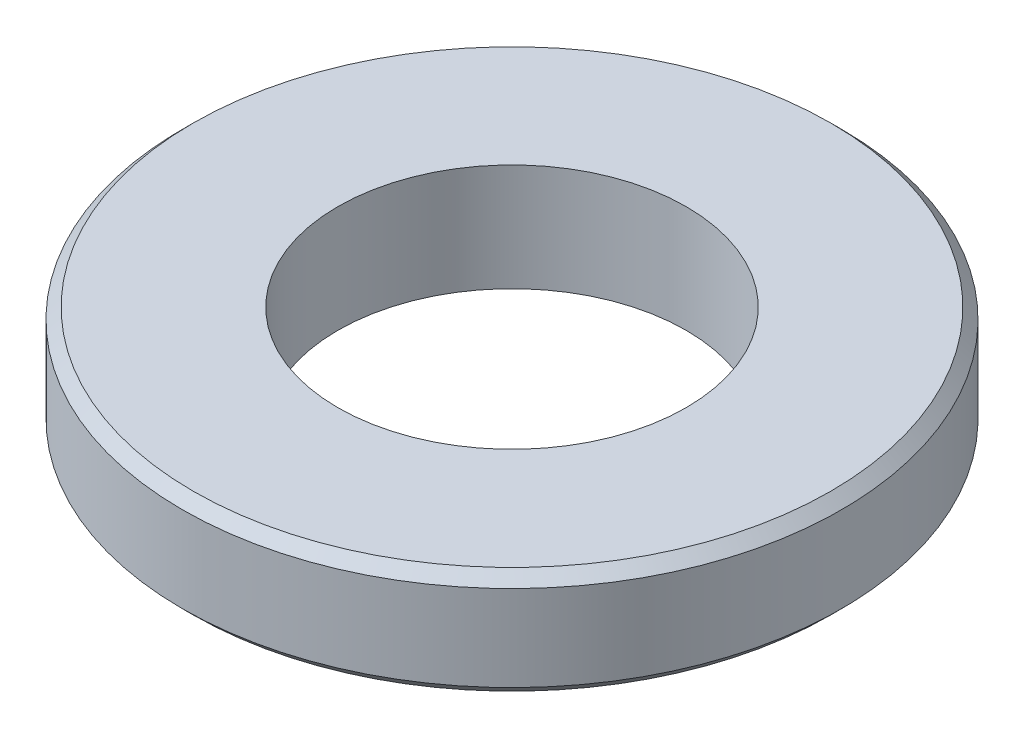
ISO-10303-21;
HEADER;
FILE_DESCRIPTION(('STEP AP214'),'2;1');
FILE_NAME('part.step','',(''),(''),'','','');
FILE_SCHEMA(('AUTOMOTIVE_DESIGN { 1 0 10303 214 1 1 1 1 }'));
ENDSEC;
DATA;
#1=APPLICATION_CONTEXT('core data for automotive mechanical design processes');
#2=APPLICATION_PROTOCOL_DEFINITION('international standard','automotive_design',2000,#1);
#3=PRODUCT_CONTEXT('',#1,'mechanical');
#4=PRODUCT('Part','Part','',(#3));
#5=PRODUCT_RELATED_PRODUCT_CATEGORY('part','',(#4));
#6=PRODUCT_DEFINITION_FORMATION('','',#4);
#7=PRODUCT_DEFINITION_CONTEXT('part definition',#1,'design');
#8=PRODUCT_DEFINITION('design','',#6,#7);
#9=PRODUCT_DEFINITION_SHAPE('','',#8);
#10=(LENGTH_UNIT() NAMED_UNIT(*) SI_UNIT(.MILLI.,.METRE.));
#11=(NAMED_UNIT(*) PLANE_ANGLE_UNIT() SI_UNIT($,.RADIAN.));
#12=(NAMED_UNIT(*) SI_UNIT($,.STERADIAN.) SOLID_ANGLE_UNIT());
#13=UNCERTAINTY_MEASURE_WITH_UNIT(LENGTH_MEASURE(1.E-05),#10,'distance_accuracy_value','');
#14=(GEOMETRIC_REPRESENTATION_CONTEXT(3) GLOBAL_UNCERTAINTY_ASSIGNED_CONTEXT((#13)) GLOBAL_UNIT_ASSIGNED_CONTEXT((#10,
#11,#12)) REPRESENTATION_CONTEXT('',''));
#15=CARTESIAN_POINT('',(0.,0.,0.));
#16=DIRECTION('',(0.,0.,1.));
#17=DIRECTION('',(1.,0.,0.));
#18=AXIS2_PLACEMENT_3D('',#15,#16,#17);
#19=CARTESIAN_POINT('',(0.,4.,0.));
#20=DIRECTION('',(0.,1.,0.));
#21=DIRECTION('',(0.,0.,1.));
#22=AXIS2_PLACEMENT_3D('',#19,#20,#21);
#23=PLANE('',#22);
#24=CARTESIAN_POINT('',(0.,4.,0.));
#25=DIRECTION('',(0.,1.,0.));
#26=DIRECTION('',(0.,0.,1.));
#27=AXIS2_PLACEMENT_3D('',#24,#25,#26);
#28=CIRCLE('',#27,11.9);
#29=CARTESIAN_POINT('',(0.,4.,11.9));
#30=VERTEX_POINT('',#29);
#31=EDGE_CURVE('E10',#30,#30,#28,.T.);
#32=ORIENTED_EDGE('',*,*,#31,.T.);
#33=EDGE_LOOP('',(#32));
#34=FACE_BOUND('',#33,.T.);
#35=CARTESIAN_POINT('',(0.,4.,0.));
#36=DIRECTION('',(0.,1.,0.));
#37=DIRECTION('',(0.,0.,1.));
#38=AXIS2_PLACEMENT_3D('',#35,#36,#37);
#39=CIRCLE('',#38,6.5);
#40=CARTESIAN_POINT('',(0.,4.,6.5));
#41=VERTEX_POINT('',#40);
#42=EDGE_CURVE('E50',#41,#41,#39,.T.);
#43=ORIENTED_EDGE('',*,*,#42,.F.);
#44=EDGE_LOOP('',(#43));
#45=FACE_BOUND('',#44,.T.);
#46=ADVANCED_FACE('F30',(#34,#45),#23,.T.);
#47=CARTESIAN_POINT('',(0.,0.,0.));
#48=DIRECTION('',(0.,1.,0.));
#49=DIRECTION('',(0.,0.,1.));
#50=AXIS2_PLACEMENT_3D('',#47,#48,#49);
#51=PLANE('',#50);
#52=CARTESIAN_POINT('',(0.,0.,0.));
#53=DIRECTION('',(0.,1.,0.));
#54=DIRECTION('',(0.,0.,1.));
#55=AXIS2_PLACEMENT_3D('',#52,#53,#54);
#56=CIRCLE('',#55,11.9);
#57=CARTESIAN_POINT('',(0.,0.,11.9));
#58=VERTEX_POINT('',#57);
#59=EDGE_CURVE('E37',#58,#58,#56,.F.);
#60=ORIENTED_EDGE('',*,*,#59,.T.);
#61=EDGE_LOOP('',(#60));
#62=FACE_BOUND('',#61,.T.);
#63=CARTESIAN_POINT('',(0.,0.,0.));
#64=DIRECTION('',(0.,1.,0.));
#65=DIRECTION('',(0.,0.,1.));
#66=AXIS2_PLACEMENT_3D('',#63,#64,#65);
#67=CIRCLE('',#66,6.5);
#68=CARTESIAN_POINT('',(0.,0.,6.5));
#69=VERTEX_POINT('',#68);
#70=EDGE_CURVE('E51',#69,#69,#67,.T.);
#71=ORIENTED_EDGE('',*,*,#70,.T.);
#72=EDGE_LOOP('',(#71));
#73=FACE_BOUND('',#72,.T.);
#74=ADVANCED_FACE('F61',(#62,#73),#51,.F.);
#75=CARTESIAN_POINT('',(0.,4.,0.));
#76=DIRECTION('',(0.,-1.,0.));
#77=DIRECTION('',(0.,0.,-1.));
#78=AXIS2_PLACEMENT_3D('',#75,#76,#77);
#79=CYLINDRICAL_SURFACE('',#78,12.3);
#80=CARTESIAN_POINT('',(0.,0.399999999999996,0.));
#81=DIRECTION('',(0.,1.,0.));
#82=DIRECTION('',(0.,0.,1.));
#83=AXIS2_PLACEMENT_3D('',#80,#81,#82);
#84=CIRCLE('',#83,12.3);
#85=CARTESIAN_POINT('',(0.,0.399999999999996,12.3));
#86=VERTEX_POINT('',#85);
#87=EDGE_CURVE('E41',#86,#86,#84,.T.);
#88=ORIENTED_EDGE('',*,*,#87,.T.);
#89=EDGE_LOOP('',(#88));
#90=FACE_BOUND('',#89,.T.);
#91=CARTESIAN_POINT('',(0.,3.6,0.));
#92=DIRECTION('',(0.,1.,0.));
#93=DIRECTION('',(0.,0.,1.));
#94=AXIS2_PLACEMENT_3D('',#91,#92,#93);
#95=CIRCLE('',#94,12.3);
#96=CARTESIAN_POINT('',(0.,3.6,12.3));
#97=VERTEX_POINT('',#96);
#98=EDGE_CURVE('E45',#97,#97,#95,.F.);
#99=ORIENTED_EDGE('',*,*,#98,.T.);
#100=EDGE_LOOP('',(#99));
#101=FACE_BOUND('',#100,.T.);
#102=ADVANCED_FACE('F66',(#90,#101),#79,.T.);
#103=CARTESIAN_POINT('',(0.,4.,0.));
#104=DIRECTION('',(0.,-1.,0.));
#105=DIRECTION('',(0.,0.,-1.));
#106=AXIS2_PLACEMENT_3D('',#103,#104,#105);
#107=CYLINDRICAL_SURFACE('',#106,6.5);
#108=ORIENTED_EDGE('',*,*,#42,.T.);
#109=EDGE_LOOP('',(#108));
#110=FACE_BOUND('',#109,.T.);
#111=ORIENTED_EDGE('',*,*,#70,.F.);
#112=EDGE_LOOP('',(#111));
#113=FACE_BOUND('',#112,.T.);
#114=ADVANCED_FACE('F57',(#110,#113),#107,.F.);
#115=CARTESIAN_POINT('',(0.,0.399999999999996,0.));
#116=DIRECTION('',(0.,1.,0.));
#117=DIRECTION('',(0.,0.,1.));
#118=AXIS2_PLACEMENT_3D('',#115,#116,#117);
#119=CONICAL_SURFACE('',#118,12.3,0.78539816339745);
#120=ORIENTED_EDGE('',*,*,#59,.F.);
#121=EDGE_LOOP('',(#120));
#122=FACE_BOUND('',#121,.T.);
#123=ORIENTED_EDGE('',*,*,#87,.F.);
#124=EDGE_LOOP('',(#123));
#125=FACE_BOUND('',#124,.T.);
#126=ADVANCED_FACE('F72',(#122,#125),#119,.T.);
#127=CARTESIAN_POINT('',(0.,4.,0.));
#128=DIRECTION('',(0.,-1.,0.));
#129=DIRECTION('',(0.,0.,-1.));
#130=AXIS2_PLACEMENT_3D('',#127,#128,#129);
#131=CONICAL_SURFACE('',#130,11.9,0.785398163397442);
#132=ORIENTED_EDGE('',*,*,#98,.F.);
#133=EDGE_LOOP('',(#132));
#134=FACE_BOUND('',#133,.T.);
#135=ORIENTED_EDGE('',*,*,#31,.F.);
#136=EDGE_LOOP('',(#135));
#137=FACE_BOUND('',#136,.T.);
#138=ADVANCED_FACE('F32',(#134,#137),#131,.T.);
#139=CLOSED_SHELL('',(#46,#74,#102,#114,#126,#138));
#140=MANIFOLD_SOLID_BREP('B2',#139);
#141=ADVANCED_BREP_SHAPE_REPRESENTATION('',(#18,#140),#14);
#142=SHAPE_DEFINITION_REPRESENTATION(#9,#141);
ENDSEC;
END-ISO-10303-21;
